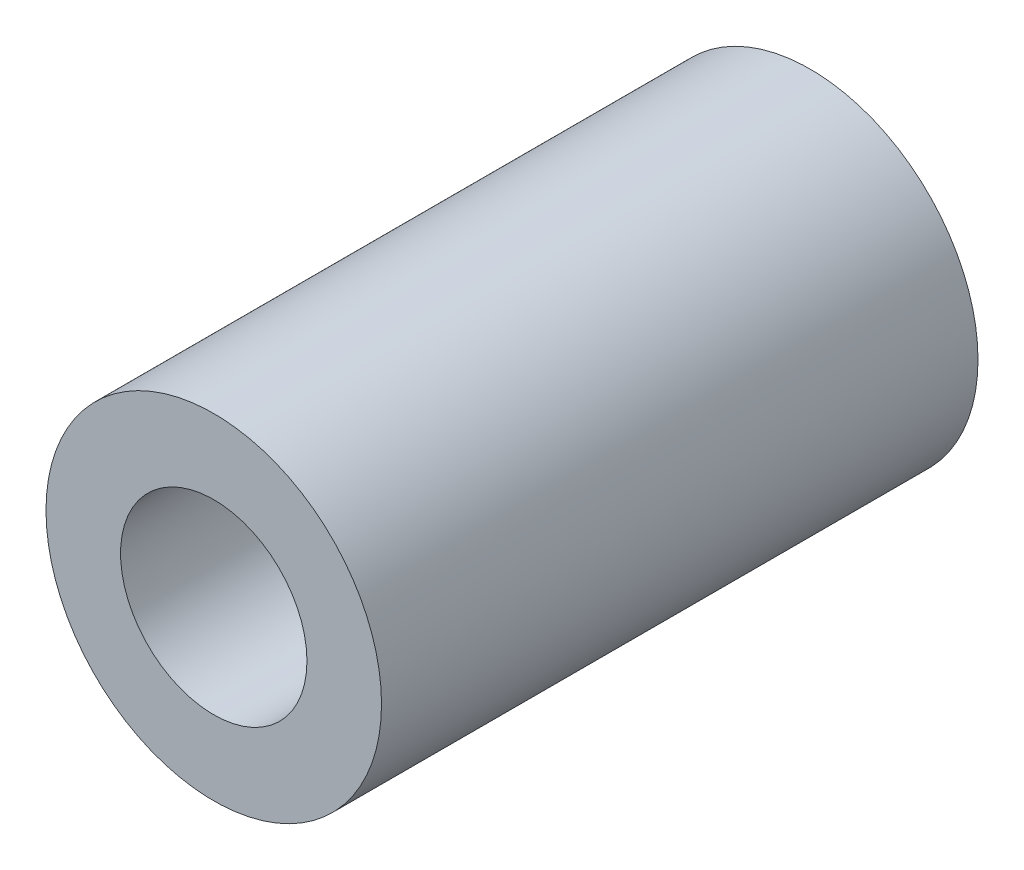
from build123d import *

# Parameters (mm, degrees)
ESBO_O1_R                = 13.5
ESBO_O1_R_2              = 7.5
RESSALTO_EXTRUS_O1_DEPTH = 48


with BuildPart() as part:
    # Esbo_o1 → Ressalto-extrus_o1 (new body)
    with BuildSketch(Plane.XY):
        Circle(ESBO_O1_R)
        Circle(ESBO_O1_R_2, mode=Mode.SUBTRACT)
    extrude(amount=RESSALTO_EXTRUS_O1_DEPTH)


solid = part.part
